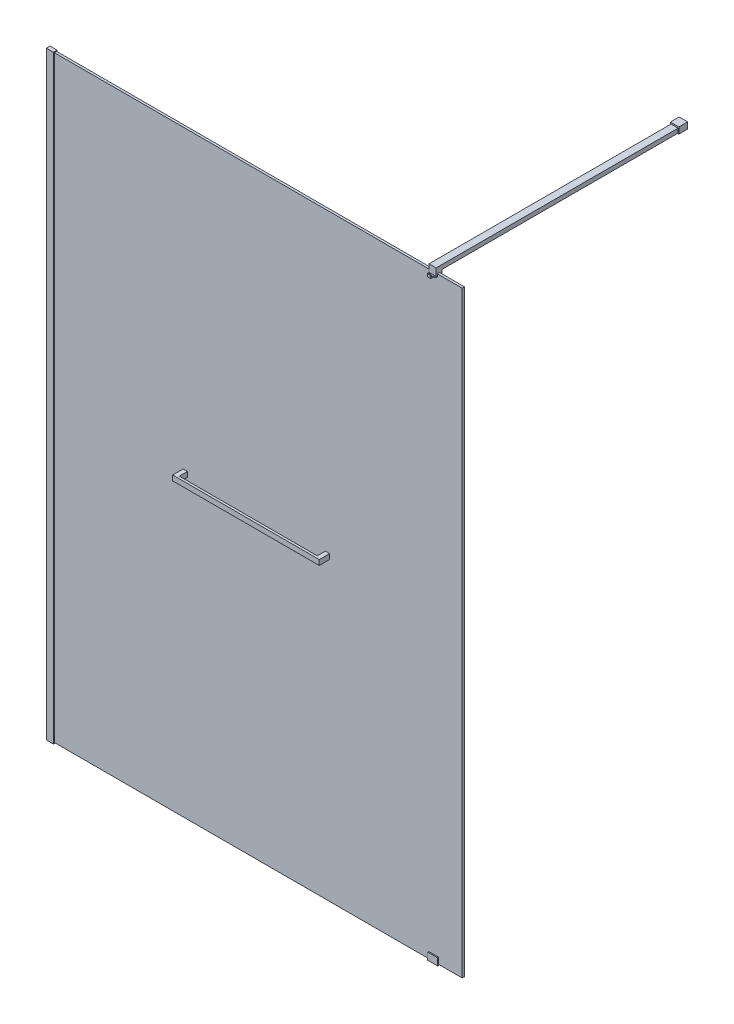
from build123d import *

# Parameters (mm, degrees)
DODANIE_WYCI_GNI_CIE1_DEPTH     = 2100
SZKIC2_W                        = 1447
SZKIC2_H                        = 8
DODANIE_WYCI_GNI_CIE2_DEPTH     = 2100
SZKIC4_W                        = 25
SZKIC4_H                        = 13.3
DODANIE_WYCI_GNI_CIE3_DEPTH     = 3
SZKIC5_W                        = 25
SZKIC5_H                        = 13.3
DODANIE_WYCI_GNI_CIE4_DEPTH     = 3
DODANIE_WYCI_GNI_CIE5_DEPTH     = 17.5
DODANIE_WYCI_GNI_CIE6_DEPTH     = 12.5
WYTNIJ_WYCI_GNI_CIE1_DEPTH      = 2560.308844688
WYTNIJ_WYCI_GNI_CIE1_DEPTH_BACK = 2560.308844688
SZKIC10_W                       = 25
SZKIC10_H                       = 861.63
DODANIE_WYCI_GNI_CIE7_DEPTH     = 15
SZKIC14_W                       = 30
SZKIC14_H                       = 22
DODANIE_WYCI_GNI_CIE8_DEPTH     = 31
POLKA_1A_DEPTH                  = 36.5
POLKA_1A_DEPTH_BACK             = 31
SZKIC17_W                       = 15
SZKIC17_H                       = 18
POLKA_1A_2_DEPTH                = 36.5
POLKA_1A_2_DEPTH_BACK           = 31
POLKA_1B_START                  = -515
SZKIC18_W                       = 12.8
SZKIC18_H                       = 8
POLKA_1B_DEPTH                  = 515
POLKA_1C_START                  = -5.28
SZKIC19_W                       = 515
SZKIC19_H                       = 80
POLKA_1C_DEPTH                  = 8
SZKIC20_W                       = 8
SZKIC20_H                       = 18
POLKA_1D_DEPTH                  = 485


with BuildPart() as part:
    # Szkic1 → Dodanie-wyci_gni_cie1 (new body)
    with BuildSketch(Plane(origin=(0, 0, 0), x_dir=(1, 0, 0), z_dir=(0, 1, 0))):
        Polygon((0, 0), (0, 13.3), (25, 13.3), (25, 11.4), (11.45, 11.4), (11.45, 3.4), (25, 3.4), (25, 0), align=None)
    extrude(amount=DODANIE_WYCI_GNI_CIE1_DEPTH)

    # Szkic4 → Dodanie-wyci_gni_cie3 (add)
    with BuildSketch(Plane(origin=(0, 2100, 0), x_dir=(1, 0, 0), z_dir=(0, 1, 0))):
        with Locations((12.5, 6.65)):
            Rectangle(SZKIC4_W, SZKIC4_H)
    extrude(amount=DODANIE_WYCI_GNI_CIE3_DEPTH)

    # Szkic5 → Dodanie-wyci_gni_cie4 (add)
    with BuildSketch(Plane.XZ):
        with Locations((12.5, -6.65)):
            Rectangle(SZKIC5_W, SZKIC5_H)
    extrude(amount=DODANIE_WYCI_GNI_CIE4_DEPTH)


with BuildPart() as body_2:
    # Szkic2 → Dodanie-wyci_gni_cie2 (new body)
    with BuildSketch(Plane.XZ):
        with Locations((734.95, -7.4)):
            Rectangle(SZKIC2_W, SZKIC2_H)
    extrude(amount=-DODANIE_WYCI_GNI_CIE2_DEPTH)


with BuildPart() as body_3:
    # Szkic6 → Dodanie-wyci_gni_cie5 (new, symmetric)
    with BuildSketch(Plane(origin=(1358.45, 0, 0), x_dir=(0, 0, -1), z_dir=(1, 0, 0))):
        Polygon((11.4, 22), (15.75, 22), (15.75, -3), (-0.35, -3), (-0.35, 22), (3.4, 22), (3.4, 0), (11.4, 0), align=None)
    extrude(amount=DODANIE_WYCI_GNI_CIE5_DEPTH, both=True)


with BuildPart() as body_4:
    # Szkic7 → Dodanie-wyci_gni_cie6 (new, symmetric)
    with BuildSketch(Plane(origin=(1358.45, 0, 0), x_dir=(0, 0, -1), z_dir=(1, 0, 0))):
        Polygon((-0.6, 2120), (19.4, 2120), (19.4, 2090), (11.4, 2090), (11.4, 2100), (3.4, 2100), (3.4, 2090), (-13.37, 2090), (-13.37, 2100), (-10.37, 2100), (-9.845068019, 2094), (-0.6, 2094), align=None)
    extrude(amount=DODANIE_WYCI_GNI_CIE6_DEPTH, both=True)

    # Szkic8 → Wytnij-wyci_gni_cie1 (cut, two sides: drawn at the far end of the back side and taken through both)
    with BuildSketch(Plane(origin=(0, 2100, 0), x_dir=(1, 0, 0), z_dir=(0, 1, 0)).offset(-WYTNIJ_WYCI_GNI_CIE1_DEPTH_BACK)):
        Polygon((-1148.382817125, 1162.526494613), (1345.95, -0.6), (1352.45, -3.630999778), (1352.45, -13.37), (1364.45, -13.37), (1364.45, -3.630999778), (1370.95, -0.6), (3865.282817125, 1162.526494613), (3865.282817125, -4341.857011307), (-1148.382817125, -4341.857011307), align=None)
    extrude(amount=WYTNIJ_WYCI_GNI_CIE1_DEPTH + WYTNIJ_WYCI_GNI_CIE1_DEPTH_BACK, mode=Mode.SUBTRACT)

    # Szkic10 → Dodanie-wyci_gni_cie7 (add)
    with BuildSketch(Plane(origin=(0, 2120, 0), x_dir=(1, 0, 0), z_dir=(0, 1, 0))):
        with Locations((1358.45, 450.215)):
            Rectangle(SZKIC10_W, SZKIC10_H)
    extrude(amount=-DODANIE_WYCI_GNI_CIE7_DEPTH)

    # Szkic14 → Dodanie-wyci_gni_cie8 (add)
    with BuildSketch(Plane(origin=(0, 0, -881.03), x_dir=(-1, 0, 0), z_dir=(0, 0, -1))):
        with Locations((-1358.45, 2114)):
            Rectangle(SZKIC14_W, SZKIC14_H)
    extrude(amount=-DODANIE_WYCI_GNI_CIE8_DEPTH)


with BuildPart() as body_5:
    # Szkic17 → polka_1a (new, two sides: drawn at the far end of the back side and taken through both)
    with BuildSketch(Plane.XY.offset(-3.4).offset(-POLKA_1A_DEPTH_BACK)):
        with Locations((484.95, 1050)):
            Rectangle(SZKIC17_W, SZKIC17_H)
    extrude(amount=POLKA_1A_DEPTH + POLKA_1A_DEPTH_BACK)


with BuildPart() as body_6:
    # Szkic17 → polka_1a 2 (new, two sides: drawn at the far end of the back side and taken through both)
    with BuildSketch(Plane.XY.offset(-3.4).offset(-POLKA_1A_2_DEPTH_BACK)):
        with Locations((984.95, 1050)):
            Rectangle(SZKIC17_W, SZKIC17_H)
    extrude(amount=POLKA_1A_2_DEPTH + POLKA_1A_2_DEPTH_BACK)


with BuildPart() as polka_1b_tool:
    # Szkic18 → polka_1b (new body)
    with BuildSketch(Plane.ZY.offset(-477.45).offset(POLKA_1B_START)):
        with Locations((-28, 1049.73)):
            Rectangle(SZKIC18_W, SZKIC18_H)
    extrude(amount=POLKA_1B_DEPTH)


with BuildPart() as body_5_1:
    add(body_5.part)

    # polka_1b: cut by polka_1b_tool
    add(polka_1b_tool.part, mode=Mode.SUBTRACT)



with BuildPart() as body_6_1:
    add(body_6.part)

    # polka_1b: cut by polka_1b_tool
    add(polka_1b_tool.part, mode=Mode.SUBTRACT)


with BuildPart() as body_7:
    # Szkic19 → polka_1c (new body)
    with BuildSketch(Plane(origin=(0, 1059, 0), x_dir=(1, 0, 0), z_dir=(0, 1, 0)).offset(POLKA_1C_START)):
        with Locations((734.95, 61.6)):
            Rectangle(SZKIC19_W, SZKIC19_H)
    extrude(amount=-POLKA_1C_DEPTH)


with BuildPart() as body_5_2:
    add(body_5_1.part)

    add(body_6_1.part)  # polka_1d merges body 6
    # Szkic20 → polka_1d (add)
    with BuildSketch(Plane(origin=(492.45, 0, 0), x_dir=(0, 0, -1), z_dir=(1, 0, 0))):
        with Locations((-29.1, 1050)):
            Rectangle(SZKIC20_W, SZKIC20_H)
    extrude(amount=POLKA_1D_DEPTH)


solid = Compound([part.part, body_2.part, body_3.part, body_4.part, body_7.part, body_5_2.part])
